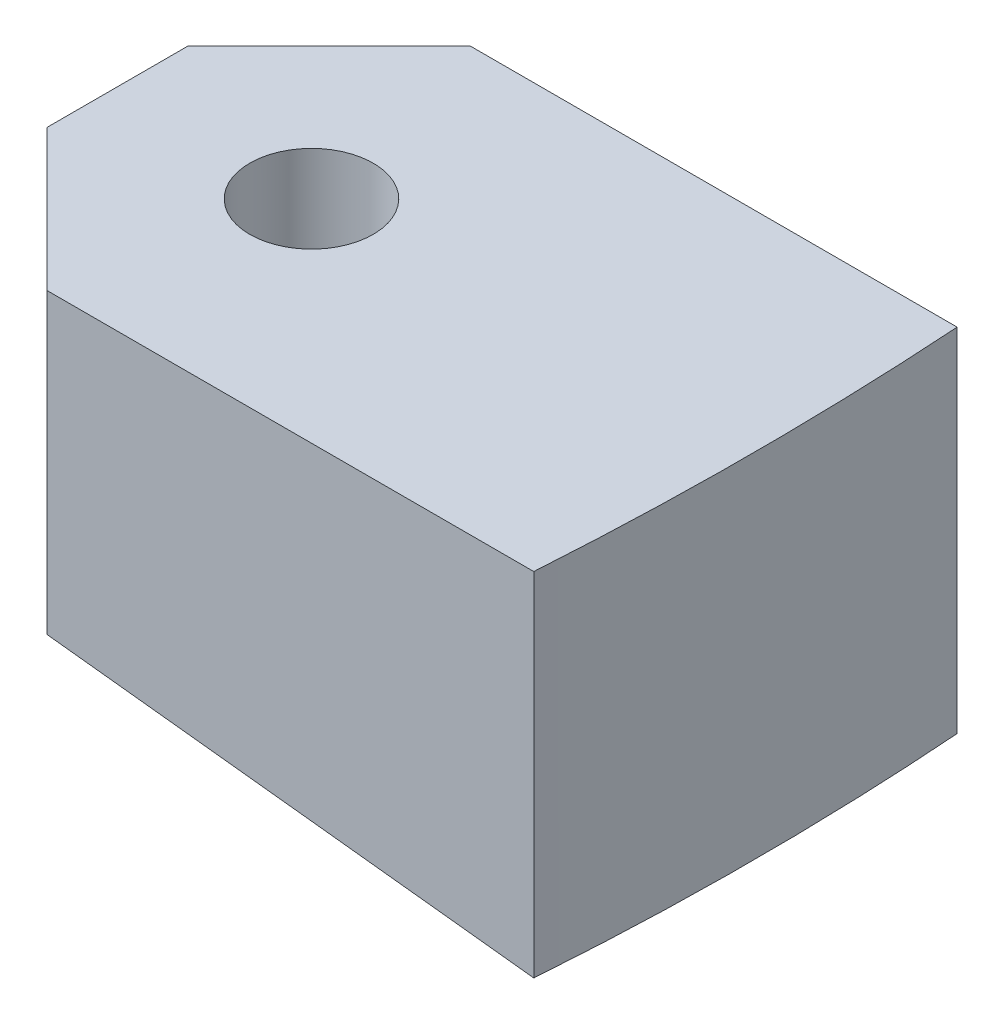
from build123d import *

# Parameters (mm, degrees)
BOSS_EXTRU_1_DEPTH      = 30
ESQUISSE2_R             = 500
ESQUISSE2_R_2           = 452.5
ENL_V_MAT_EXTRU_1_DEPTH = 108.238052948
TROU_TARAUD_M201_D      = 17.5
CHANFREIN1_SIZE         = 20


with BuildPart() as part:
    # Esquisse1 → Boss.-Extru.1 (new, symmetric)
    with BuildSketch(Plane.XY):
        Polygon((0, 0), (90, 0), (90, -50), (0, -40), align=None)
    extrude(amount=BOSS_EXTRU_1_DEPTH, both=True)

    # Esquisse2 → Enl_v. mat.-Extru.1 (cut, through all)
    with BuildSketch(Plane(origin=(0, 0, 0), x_dir=(1, 0, 0), z_dir=(0, 1, 0))):
        with Locations((-362.5, 0)):
            Circle(ESQUISSE2_R)
        with Locations((-362.5, 0)):
            Circle(ESQUISSE2_R_2, mode=Mode.SUBTRACT)
    extrude(amount=-ENL_V_MAT_EXTRU_1_DEPTH, mode=Mode.SUBTRACT)

    # Trou taraud_ M201 (through all)
    with Locations(Plane(origin=(0, 0, 0), x_dir=(1, 0, 0), z_dir=(0, 1, 0))):
        with Locations((27.5, 0)):
            Hole(TROU_TARAUD_M201_D / 2)

    # Chanfrein1
    chanfrein1_edges = [part.edges().sort_by_distance(p)[0] for p in [
        (0, -20, 30),
        (0, -20, -30),
    ]]
    chamfer(chanfrein1_edges, length=CHANFREIN1_SIZE)


solid = part.part
